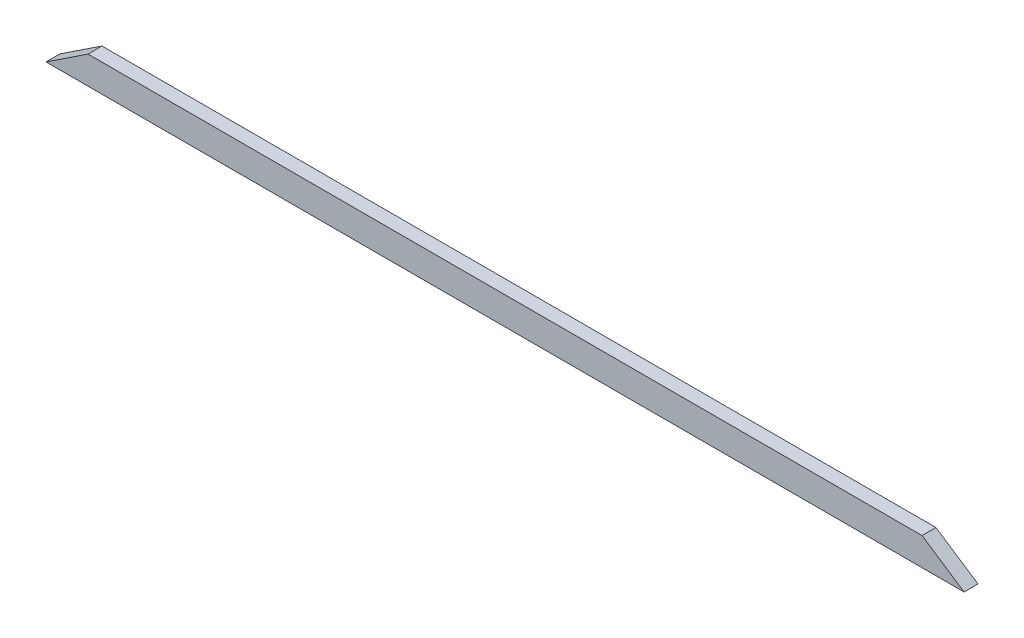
ISO-10303-21;
HEADER;
FILE_DESCRIPTION(('STEP AP214'),'2;1');
FILE_NAME('part.step','',(''),(''),'','','');
FILE_SCHEMA(('AUTOMOTIVE_DESIGN { 1 0 10303 214 1 1 1 1 }'));
ENDSEC;
DATA;
#1=APPLICATION_CONTEXT('core data for automotive mechanical design processes');
#2=APPLICATION_PROTOCOL_DEFINITION('international standard','automotive_design',2000,#1);
#3=PRODUCT_CONTEXT('',#1,'mechanical');
#4=PRODUCT('Part','Part','',(#3));
#5=PRODUCT_RELATED_PRODUCT_CATEGORY('part','',(#4));
#6=PRODUCT_DEFINITION_FORMATION('','',#4);
#7=PRODUCT_DEFINITION_CONTEXT('part definition',#1,'design');
#8=PRODUCT_DEFINITION('design','',#6,#7);
#9=PRODUCT_DEFINITION_SHAPE('','',#8);
#10=(LENGTH_UNIT() NAMED_UNIT(*) SI_UNIT(.MILLI.,.METRE.));
#11=(NAMED_UNIT(*) PLANE_ANGLE_UNIT() SI_UNIT($,.RADIAN.));
#12=(NAMED_UNIT(*) SI_UNIT($,.STERADIAN.) SOLID_ANGLE_UNIT());
#13=UNCERTAINTY_MEASURE_WITH_UNIT(LENGTH_MEASURE(1.E-05),#10,'distance_accuracy_value','');
#14=(GEOMETRIC_REPRESENTATION_CONTEXT(3) GLOBAL_UNCERTAINTY_ASSIGNED_CONTEXT((#13)) GLOBAL_UNIT_ASSIGNED_CONTEXT((#10,
#11,#12)) REPRESENTATION_CONTEXT('',''));
#15=CARTESIAN_POINT('',(0.,0.,0.));
#16=DIRECTION('',(0.,0.,1.));
#17=DIRECTION('',(1.,0.,0.));
#18=AXIS2_PLACEMENT_3D('',#15,#16,#17);
#19=CARTESIAN_POINT('',(-12.2147932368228,0.,5.));
#20=DIRECTION('',(0.55179143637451,-0.833982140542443,0.));
#21=DIRECTION('',(0.833982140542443,0.55179143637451,0.));
#22=AXIS2_PLACEMENT_3D('',#19,#20,#21);
#23=PLANE('',#22);
#24=DIRECTION('',(-0.833982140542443,-0.55179143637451,0.));
#25=VECTOR('',#24,1.);
#26=CARTESIAN_POINT('',(-12.2147932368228,0.,0.));
#27=LINE('',#26,#25);
#28=CARTESIAN_POINT('',(2.89928946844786,10.,0.));
#29=VERTEX_POINT('',#28);
#30=CARTESIAN_POINT('',(-12.2147932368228,0.,0.));
#31=VERTEX_POINT('',#30);
#32=EDGE_CURVE('E70',#29,#31,#27,.T.);
#33=ORIENTED_EDGE('',*,*,#32,.T.);
#34=DIRECTION('',(0.,0.,-1.));
#35=VECTOR('',#34,1.);
#36=CARTESIAN_POINT('',(-12.2147932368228,0.,5.));
#37=LINE('',#36,#35);
#38=CARTESIAN_POINT('',(-12.2147932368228,0.,5.));
#39=VERTEX_POINT('',#38);
#40=EDGE_CURVE('E11',#39,#31,#37,.T.);
#41=ORIENTED_EDGE('',*,*,#40,.F.);
#42=DIRECTION('',(-0.833982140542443,-0.55179143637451,0.));
#43=VECTOR('',#42,1.);
#44=CARTESIAN_POINT('',(-12.2147932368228,0.,5.));
#45=LINE('',#44,#43);
#46=CARTESIAN_POINT('',(2.89928946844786,10.,5.));
#47=VERTEX_POINT('',#46);
#48=EDGE_CURVE('E88',#47,#39,#45,.T.);
#49=ORIENTED_EDGE('',*,*,#48,.F.);
#50=DIRECTION('',(0.,0.,-1.));
#51=VECTOR('',#50,1.);
#52=CARTESIAN_POINT('',(2.89928946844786,10.,5.));
#53=LINE('',#52,#51);
#54=EDGE_CURVE('E82',#47,#29,#53,.T.);
#55=ORIENTED_EDGE('',*,*,#54,.T.);
#56=EDGE_LOOP('',(#33,#41,#49,#55));
#57=FACE_BOUND('',#56,.T.);
#58=ADVANCED_FACE('F26',(#57),#23,.F.);
#59=CARTESIAN_POINT('',(-12.2147932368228,0.,5.));
#60=DIRECTION('',(0.,1.,0.));
#61=DIRECTION('',(0.,0.,1.));
#62=AXIS2_PLACEMENT_3D('',#59,#60,#61);
#63=PLANE('',#62);
#64=DIRECTION('',(1.,0.,0.));
#65=VECTOR('',#64,1.);
#66=CARTESIAN_POINT('',(-12.2147932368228,0.,0.));
#67=LINE('',#66,#65);
#68=CARTESIAN_POINT('',(317.785206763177,0.,0.));
#69=VERTEX_POINT('',#68);
#70=EDGE_CURVE('E66',#31,#69,#67,.T.);
#71=ORIENTED_EDGE('',*,*,#70,.T.);
#72=DIRECTION('',(0.,0.,-1.));
#73=VECTOR('',#72,1.);
#74=CARTESIAN_POINT('',(317.785206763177,0.,5.));
#75=LINE('',#74,#73);
#76=CARTESIAN_POINT('',(317.785206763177,0.,5.));
#77=VERTEX_POINT('',#76);
#78=EDGE_CURVE('E33',#77,#69,#75,.T.);
#79=ORIENTED_EDGE('',*,*,#78,.F.);
#80=DIRECTION('',(1.,0.,0.));
#81=VECTOR('',#80,1.);
#82=CARTESIAN_POINT('',(-12.2147932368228,0.,5.));
#83=LINE('',#82,#81);
#84=EDGE_CURVE('E78',#39,#77,#83,.T.);
#85=ORIENTED_EDGE('',*,*,#84,.F.);
#86=ORIENTED_EDGE('',*,*,#40,.T.);
#87=EDGE_LOOP('',(#71,#79,#85,#86));
#88=FACE_BOUND('',#87,.T.);
#89=ADVANCED_FACE('F77',(#88),#63,.F.);
#90=CARTESIAN_POINT('',(317.785206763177,0.,5.));
#91=DIRECTION('',(-0.551791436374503,-0.833982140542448,0.));
#92=DIRECTION('',(0.833982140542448,-0.551791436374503,0.));
#93=AXIS2_PLACEMENT_3D('',#90,#91,#92);
#94=PLANE('',#93);
#95=DIRECTION('',(-0.833982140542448,0.551791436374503,0.));
#96=VECTOR('',#95,1.);
#97=CARTESIAN_POINT('',(317.785206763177,0.,0.));
#98=LINE('',#97,#96);
#99=CARTESIAN_POINT('',(302.671124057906,10.,0.));
#100=VERTEX_POINT('',#99);
#101=EDGE_CURVE('E71',#69,#100,#98,.T.);
#102=ORIENTED_EDGE('',*,*,#101,.T.);
#103=DIRECTION('',(0.,0.,-1.));
#104=VECTOR('',#103,1.);
#105=CARTESIAN_POINT('',(302.671124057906,10.,5.));
#106=LINE('',#105,#104);
#107=CARTESIAN_POINT('',(302.671124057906,10.,5.));
#108=VERTEX_POINT('',#107);
#109=EDGE_CURVE('E94',#108,#100,#106,.T.);
#110=ORIENTED_EDGE('',*,*,#109,.F.);
#111=DIRECTION('',(-0.833982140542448,0.551791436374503,0.));
#112=VECTOR('',#111,1.);
#113=CARTESIAN_POINT('',(317.785206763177,0.,5.));
#114=LINE('',#113,#112);
#115=EDGE_CURVE('E45',#77,#108,#114,.T.);
#116=ORIENTED_EDGE('',*,*,#115,.F.);
#117=ORIENTED_EDGE('',*,*,#78,.T.);
#118=EDGE_LOOP('',(#102,#110,#116,#117));
#119=FACE_BOUND('',#118,.T.);
#120=ADVANCED_FACE('F97',(#119),#94,.F.);
#121=CARTESIAN_POINT('',(2.89928946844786,10.,5.));
#122=DIRECTION('',(0.,-1.,0.));
#123=DIRECTION('',(0.,0.,-1.));
#124=AXIS2_PLACEMENT_3D('',#121,#122,#123);
#125=PLANE('',#124);
#126=DIRECTION('',(-1.,0.,0.));
#127=VECTOR('',#126,1.);
#128=CARTESIAN_POINT('',(2.89928946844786,10.,0.));
#129=LINE('',#128,#127);
#130=EDGE_CURVE('E86',#100,#29,#129,.T.);
#131=ORIENTED_EDGE('',*,*,#130,.T.);
#132=ORIENTED_EDGE('',*,*,#54,.F.);
#133=DIRECTION('',(-1.,0.,0.));
#134=VECTOR('',#133,1.);
#135=CARTESIAN_POINT('',(2.89928946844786,10.,5.));
#136=LINE('',#135,#134);
#137=EDGE_CURVE('E40',#108,#47,#136,.T.);
#138=ORIENTED_EDGE('',*,*,#137,.F.);
#139=ORIENTED_EDGE('',*,*,#109,.T.);
#140=EDGE_LOOP('',(#131,#132,#138,#139));
#141=FACE_BOUND('',#140,.T.);
#142=ADVANCED_FACE('F99',(#141),#125,.F.);
#143=CARTESIAN_POINT('',(152.785206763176,109.169708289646,5.));
#144=DIRECTION('',(0.,0.,1.));
#145=DIRECTION('',(1.,0.,0.));
#146=AXIS2_PLACEMENT_3D('',#143,#144,#145);
#147=PLANE('',#146);
#148=ORIENTED_EDGE('',*,*,#48,.T.);
#149=ORIENTED_EDGE('',*,*,#84,.T.);
#150=ORIENTED_EDGE('',*,*,#115,.T.);
#151=ORIENTED_EDGE('',*,*,#137,.T.);
#152=EDGE_LOOP('',(#148,#149,#150,#151));
#153=FACE_BOUND('',#152,.T.);
#154=ADVANCED_FACE('F100',(#153),#147,.T.);
#155=CARTESIAN_POINT('',(152.785206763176,109.169708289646,0.));
#156=DIRECTION('',(0.,0.,1.));
#157=DIRECTION('',(1.,0.,0.));
#158=AXIS2_PLACEMENT_3D('',#155,#156,#157);
#159=PLANE('',#158);
#160=ORIENTED_EDGE('',*,*,#32,.F.);
#161=ORIENTED_EDGE('',*,*,#130,.F.);
#162=ORIENTED_EDGE('',*,*,#101,.F.);
#163=ORIENTED_EDGE('',*,*,#70,.F.);
#164=EDGE_LOOP('',(#160,#161,#162,#163));
#165=FACE_BOUND('',#164,.T.);
#166=ADVANCED_FACE('F67',(#165),#159,.F.);
#167=CLOSED_SHELL('',(#58,#89,#120,#142,#154,#166));
#168=MANIFOLD_SOLID_BREP('B2',#167);
#169=ADVANCED_BREP_SHAPE_REPRESENTATION('',(#18,#168),#14);
#170=SHAPE_DEFINITION_REPRESENTATION(#9,#169);
ENDSEC;
END-ISO-10303-21;
